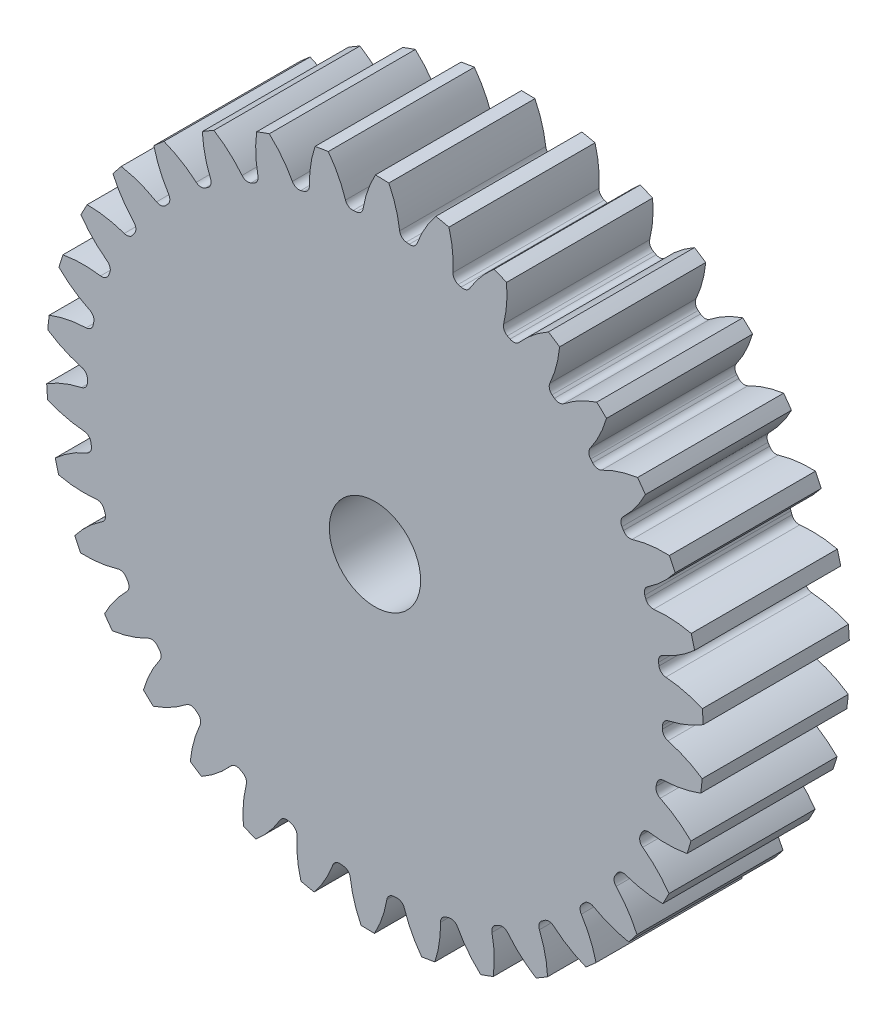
from build123d import *

# Parameters (mm, degrees)
SKETCH3_R         = 228.6
GEARBODY_DEPTH    = 101.6
TOOTHCUT_DEPTH    = 339.878267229
CIRPATTERN1_COUNT = 34
BOREDIA_R         = 31.75
BORE_DEPTH        = 12700


with BuildPart() as part:
    # Sketch3 → gearBody (new body)
    with BuildSketch(Plane.XY):
        Circle(SKETCH3_R)
    extrude(amount=GEARBODY_DEPTH)

    # Sketch2 → toothCut (cut, through all)
    with BuildSketch(Plane.XY):
        with BuildLine():
            ThreePointArc((199.951369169, -5.426840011), (199.977220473, -4.371717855), (199.997504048, -3.316473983))
            ThreePointArc((199.997504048, -3.316473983), (201.166071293, -0.127950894), (204.06101683, 1.647300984))
            ThreePointArc((204.06101683, 1.647300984), (216.758794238, 5.588257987), (228.6, 11.633962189))
            ThreePointArc((228.6, 11.633962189), (228.841171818, -5.002714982), (227.87318643, -21.612958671))
            ThreePointArc((227.87318643, -21.612958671), (216.307498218, -15.055554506), (203.794076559, -10.563453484))
            ThreePointArc((203.794076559, -10.563453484), (200.979477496, -8.663384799), (199.951369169, -5.426840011))
        make_face()
    toothcut = extrude(amount=TOOTHCUT_DEPTH, mode=Mode.SUBTRACT)

    # CirPattern1: toothCut ×34 about axis
    cirpattern1_axis = Axis((0, 0, 0), (0, 0, 1))
    for i in range(1, CIRPATTERN1_COUNT):
        add(toothcut.rotate(cirpattern1_axis, i * 360 / CIRPATTERN1_COUNT), mode=Mode.SUBTRACT)

    # boreDia → bore (cut, symmetric)
    with BuildSketch(Plane.XY):
        Circle(BOREDIA_R)
    extrude(amount=BORE_DEPTH, both=True, mode=Mode.SUBTRACT)


solid = part.part
